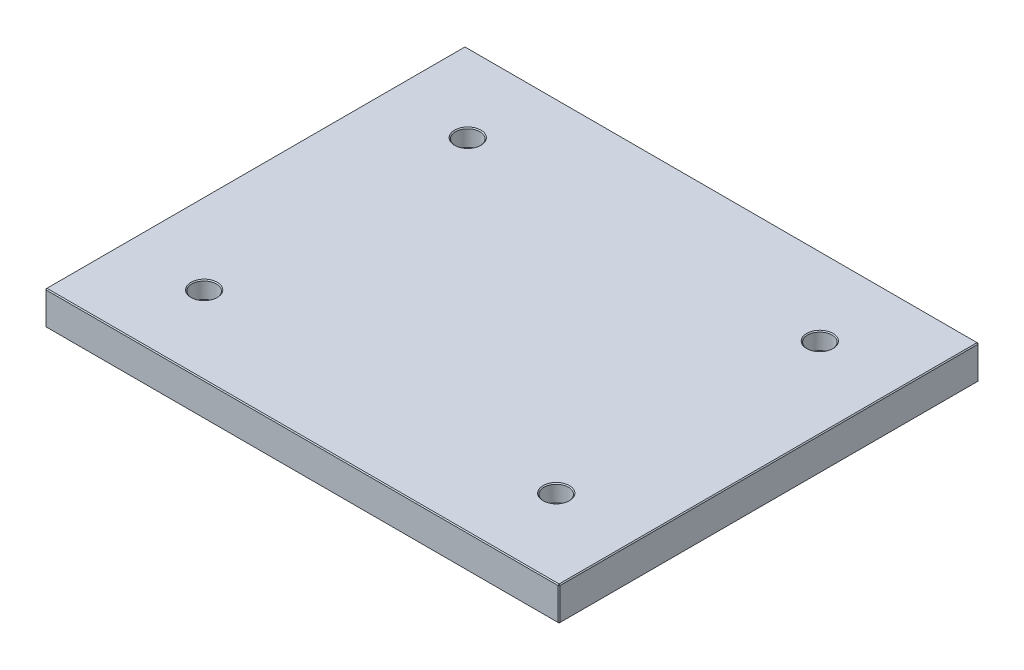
ISO-10303-21;
HEADER;
FILE_DESCRIPTION(('STEP AP214'),'2;1');
FILE_NAME('part.step','',(''),(''),'','','');
FILE_SCHEMA(('AUTOMOTIVE_DESIGN { 1 0 10303 214 1 1 1 1 }'));
ENDSEC;
DATA;
#1=APPLICATION_CONTEXT('core data for automotive mechanical design processes');
#2=APPLICATION_PROTOCOL_DEFINITION('international standard','automotive_design',2000,#1);
#3=PRODUCT_CONTEXT('',#1,'mechanical');
#4=PRODUCT('Part','Part','',(#3));
#5=PRODUCT_RELATED_PRODUCT_CATEGORY('part','',(#4));
#6=PRODUCT_DEFINITION_FORMATION('','',#4);
#7=PRODUCT_DEFINITION_CONTEXT('part definition',#1,'design');
#8=PRODUCT_DEFINITION('design','',#6,#7);
#9=PRODUCT_DEFINITION_SHAPE('','',#8);
#10=(LENGTH_UNIT() NAMED_UNIT(*) SI_UNIT(.MILLI.,.METRE.));
#11=(NAMED_UNIT(*) PLANE_ANGLE_UNIT() SI_UNIT($,.RADIAN.));
#12=(NAMED_UNIT(*) SI_UNIT($,.STERADIAN.) SOLID_ANGLE_UNIT());
#13=UNCERTAINTY_MEASURE_WITH_UNIT(LENGTH_MEASURE(1.E-05),#10,'distance_accuracy_value','');
#14=(GEOMETRIC_REPRESENTATION_CONTEXT(3) GLOBAL_UNCERTAINTY_ASSIGNED_CONTEXT((#13)) GLOBAL_UNIT_ASSIGNED_CONTEXT((#10,
#11,#12)) REPRESENTATION_CONTEXT('',''));
#15=CARTESIAN_POINT('',(0.,0.,0.));
#16=DIRECTION('',(0.,0.,1.));
#17=DIRECTION('',(1.,0.,0.));
#18=AXIS2_PLACEMENT_3D('',#15,#16,#17);
#19=CARTESIAN_POINT('',(-273.,36.,223.));
#20=DIRECTION('',(1.,0.,0.));
#21=DIRECTION('',(0.,0.,-1.));
#22=AXIS2_PLACEMENT_3D('',#19,#20,#21);
#23=PLANE('',#22);
#24=DIRECTION('',(0.,-1.,0.));
#25=VECTOR('',#24,1.);
#26=CARTESIAN_POINT('',(-273.,36.,-222.));
#27=LINE('',#26,#25);
#28=CARTESIAN_POINT('',(-273.,35.,-222.));
#29=VERTEX_POINT('',#28);
#30=CARTESIAN_POINT('',(-273.,1.00000000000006,-222.));
#31=VERTEX_POINT('',#30);
#32=EDGE_CURVE('E115',#29,#31,#27,.T.);
#33=ORIENTED_EDGE('',*,*,#32,.T.);
#34=DIRECTION('',(0.,0.,1.));
#35=VECTOR('',#34,1.);
#36=CARTESIAN_POINT('',(-273.,1.00000000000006,223.));
#37=LINE('',#36,#35);
#38=CARTESIAN_POINT('',(-273.,1.00000000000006,222.));
#39=VERTEX_POINT('',#38);
#40=EDGE_CURVE('E111',#31,#39,#37,.T.);
#41=ORIENTED_EDGE('',*,*,#40,.T.);
#42=DIRECTION('',(0.,1.,0.));
#43=VECTOR('',#42,1.);
#44=CARTESIAN_POINT('',(-273.,36.,222.));
#45=LINE('',#44,#43);
#46=CARTESIAN_POINT('',(-273.,35.,222.));
#47=VERTEX_POINT('',#46);
#48=EDGE_CURVE('E104',#39,#47,#45,.T.);
#49=ORIENTED_EDGE('',*,*,#48,.T.);
#50=DIRECTION('',(0.,0.,-1.));
#51=VECTOR('',#50,1.);
#52=CARTESIAN_POINT('',(-273.,35.,-223.));
#53=LINE('',#52,#51);
#54=EDGE_CURVE('E108',#47,#29,#53,.T.);
#55=ORIENTED_EDGE('',*,*,#54,.T.);
#56=EDGE_LOOP('',(#33,#41,#49,#55));
#57=FACE_BOUND('',#56,.T.);
#58=ADVANCED_FACE('F16',(#57),#23,.F.);
#59=CARTESIAN_POINT('',(273.,36.,223.));
#60=DIRECTION('',(0.,0.,-1.));
#61=DIRECTION('',(-1.,0.,0.));
#62=AXIS2_PLACEMENT_3D('',#59,#60,#61);
#63=PLANE('',#62);
#64=DIRECTION('',(-1.,0.,0.));
#65=VECTOR('',#64,1.);
#66=CARTESIAN_POINT('',(-273.,35.,223.));
#67=LINE('',#66,#65);
#68=CARTESIAN_POINT('',(272.,35.,223.));
#69=VERTEX_POINT('',#68);
#70=CARTESIAN_POINT('',(-272.,35.,223.));
#71=VERTEX_POINT('',#70);
#72=EDGE_CURVE('E170',#69,#71,#67,.T.);
#73=ORIENTED_EDGE('',*,*,#72,.T.);
#74=DIRECTION('',(0.,-1.,0.));
#75=VECTOR('',#74,1.);
#76=CARTESIAN_POINT('',(-272.,36.,223.));
#77=LINE('',#76,#75);
#78=CARTESIAN_POINT('',(-272.,1.00000000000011,223.));
#79=VERTEX_POINT('',#78);
#80=EDGE_CURVE('E123',#71,#79,#77,.T.);
#81=ORIENTED_EDGE('',*,*,#80,.T.);
#82=DIRECTION('',(1.,0.,0.));
#83=VECTOR('',#82,1.);
#84=CARTESIAN_POINT('',(273.,1.00000000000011,223.));
#85=LINE('',#84,#83);
#86=CARTESIAN_POINT('',(272.,1.00000000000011,223.));
#87=VERTEX_POINT('',#86);
#88=EDGE_CURVE('E174',#79,#87,#85,.T.);
#89=ORIENTED_EDGE('',*,*,#88,.T.);
#90=DIRECTION('',(0.,1.,0.));
#91=VECTOR('',#90,1.);
#92=CARTESIAN_POINT('',(272.,36.,223.));
#93=LINE('',#92,#91);
#94=EDGE_CURVE('E172',#87,#69,#93,.T.);
#95=ORIENTED_EDGE('',*,*,#94,.T.);
#96=EDGE_LOOP('',(#73,#81,#89,#95));
#97=FACE_BOUND('',#96,.T.);
#98=ADVANCED_FACE('F317',(#97),#63,.F.);
#99=CARTESIAN_POINT('',(273.,36.,223.));
#100=DIRECTION('',(-1.,0.,0.));
#101=DIRECTION('',(0.,0.,1.));
#102=AXIS2_PLACEMENT_3D('',#99,#100,#101);
#103=PLANE('',#102);
#104=DIRECTION('',(0.,0.,-1.));
#105=VECTOR('',#104,1.);
#106=CARTESIAN_POINT('',(273.,1.00000000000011,223.));
#107=LINE('',#106,#105);
#108=CARTESIAN_POINT('',(273.,1.00000000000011,222.));
#109=VERTEX_POINT('',#108);
#110=CARTESIAN_POINT('',(273.,1.00000000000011,-222.));
#111=VERTEX_POINT('',#110);
#112=EDGE_CURVE('E165',#109,#111,#107,.T.);
#113=ORIENTED_EDGE('',*,*,#112,.T.);
#114=DIRECTION('',(0.,1.,0.));
#115=VECTOR('',#114,1.);
#116=CARTESIAN_POINT('',(273.,36.,-222.));
#117=LINE('',#116,#115);
#118=CARTESIAN_POINT('',(273.,35.,-222.));
#119=VERTEX_POINT('',#118);
#120=EDGE_CURVE('E167',#111,#119,#117,.T.);
#121=ORIENTED_EDGE('',*,*,#120,.T.);
#122=DIRECTION('',(0.,0.,1.));
#123=VECTOR('',#122,1.);
#124=CARTESIAN_POINT('',(273.,35.,223.));
#125=LINE('',#124,#123);
#126=CARTESIAN_POINT('',(273.,35.,222.));
#127=VERTEX_POINT('',#126);
#128=EDGE_CURVE('E161',#119,#127,#125,.T.);
#129=ORIENTED_EDGE('',*,*,#128,.T.);
#130=DIRECTION('',(0.,-1.,0.));
#131=VECTOR('',#130,1.);
#132=CARTESIAN_POINT('',(273.,36.,222.));
#133=LINE('',#132,#131);
#134=EDGE_CURVE('E163',#127,#109,#133,.T.);
#135=ORIENTED_EDGE('',*,*,#134,.T.);
#136=EDGE_LOOP('',(#113,#121,#129,#135));
#137=FACE_BOUND('',#136,.T.);
#138=ADVANCED_FACE('F323',(#137),#103,.F.);
#139=CARTESIAN_POINT('',(273.,36.,-223.));
#140=DIRECTION('',(0.,0.,1.));
#141=DIRECTION('',(1.,0.,0.));
#142=AXIS2_PLACEMENT_3D('',#139,#140,#141);
#143=PLANE('',#142);
#144=DIRECTION('',(0.,-1.,0.));
#145=VECTOR('',#144,1.);
#146=CARTESIAN_POINT('',(272.,36.,-223.));
#147=LINE('',#146,#145);
#148=CARTESIAN_POINT('',(272.,35.,-223.));
#149=VERTEX_POINT('',#148);
#150=CARTESIAN_POINT('',(272.,1.00000000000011,-223.));
#151=VERTEX_POINT('',#150);
#152=EDGE_CURVE('E154',#149,#151,#147,.T.);
#153=ORIENTED_EDGE('',*,*,#152,.T.);
#154=DIRECTION('',(-1.,0.,0.));
#155=VECTOR('',#154,1.);
#156=CARTESIAN_POINT('',(273.,1.00000000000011,-223.));
#157=LINE('',#156,#155);
#158=CARTESIAN_POINT('',(-272.,1.00000000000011,-223.));
#159=VERTEX_POINT('',#158);
#160=EDGE_CURVE('E159',#151,#159,#157,.T.);
#161=ORIENTED_EDGE('',*,*,#160,.T.);
#162=DIRECTION('',(0.,1.,0.));
#163=VECTOR('',#162,1.);
#164=CARTESIAN_POINT('',(-272.,36.,-223.));
#165=LINE('',#164,#163);
#166=CARTESIAN_POINT('',(-272.,35.,-223.));
#167=VERTEX_POINT('',#166);
#168=EDGE_CURVE('E156',#159,#167,#165,.T.);
#169=ORIENTED_EDGE('',*,*,#168,.T.);
#170=DIRECTION('',(1.,0.,0.));
#171=VECTOR('',#170,1.);
#172=CARTESIAN_POINT('',(273.,35.,-223.));
#173=LINE('',#172,#171);
#174=EDGE_CURVE('E152',#167,#149,#173,.T.);
#175=ORIENTED_EDGE('',*,*,#174,.T.);
#176=EDGE_LOOP('',(#153,#161,#169,#175));
#177=FACE_BOUND('',#176,.T.);
#178=ADVANCED_FACE('F465',(#177),#143,.F.);
#179=CARTESIAN_POINT('',(0.,36.,0.));
#180=DIRECTION('',(0.,1.,0.));
#181=DIRECTION('',(0.,0.,1.));
#182=AXIS2_PLACEMENT_3D('',#179,#180,#181);
#183=PLANE('',#182);
#184=CARTESIAN_POINT('',(-187.,36.,140.));
#185=DIRECTION('',(0.,1.,0.));
#186=DIRECTION('',(0.,0.,1.));
#187=AXIS2_PLACEMENT_3D('',#184,#185,#186);
#188=CIRCLE('',#187,14.);
#189=CARTESIAN_POINT('',(-187.,36.,154.));
#190=VERTEX_POINT('',#189);
#191=EDGE_CURVE('E290',#190,#190,#188,.F.);
#192=ORIENTED_EDGE('',*,*,#191,.T.);
#193=EDGE_LOOP('',(#192));
#194=FACE_BOUND('',#193,.T.);
#195=CARTESIAN_POINT('',(187.,36.,140.));
#196=DIRECTION('',(0.,1.,0.));
#197=DIRECTION('',(0.,0.,1.));
#198=AXIS2_PLACEMENT_3D('',#195,#196,#197);
#199=CIRCLE('',#198,14.);
#200=CARTESIAN_POINT('',(187.,36.,154.));
#201=VERTEX_POINT('',#200);
#202=EDGE_CURVE('E287',#201,#201,#199,.F.);
#203=ORIENTED_EDGE('',*,*,#202,.T.);
#204=EDGE_LOOP('',(#203));
#205=FACE_BOUND('',#204,.T.);
#206=CARTESIAN_POINT('',(187.,36.,-140.));
#207=DIRECTION('',(0.,1.,0.));
#208=DIRECTION('',(0.,0.,1.));
#209=AXIS2_PLACEMENT_3D('',#206,#207,#208);
#210=CIRCLE('',#209,13.9999999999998);
#211=CARTESIAN_POINT('',(187.,36.,-126.));
#212=VERTEX_POINT('',#211);
#213=EDGE_CURVE('E284',#212,#212,#210,.F.);
#214=ORIENTED_EDGE('',*,*,#213,.T.);
#215=EDGE_LOOP('',(#214));
#216=FACE_BOUND('',#215,.T.);
#217=CARTESIAN_POINT('',(-187.,36.,-140.));
#218=DIRECTION('',(0.,1.,0.));
#219=DIRECTION('',(0.,0.,1.));
#220=AXIS2_PLACEMENT_3D('',#217,#218,#219);
#221=CIRCLE('',#220,14.);
#222=CARTESIAN_POINT('',(-187.,36.,-126.));
#223=VERTEX_POINT('',#222);
#224=EDGE_CURVE('E281',#223,#223,#221,.F.);
#225=ORIENTED_EDGE('',*,*,#224,.T.);
#226=EDGE_LOOP('',(#225));
#227=FACE_BOUND('',#226,.T.);
#228=DIRECTION('',(0.,0.,-1.));
#229=VECTOR('',#228,1.);
#230=CARTESIAN_POINT('',(272.,36.,-223.));
#231=LINE('',#230,#229);
#232=CARTESIAN_POINT('',(272.,36.,222.));
#233=VERTEX_POINT('',#232);
#234=CARTESIAN_POINT('',(272.,36.,-222.));
#235=VERTEX_POINT('',#234);
#236=EDGE_CURVE('E31',#233,#235,#231,.T.);
#237=ORIENTED_EDGE('',*,*,#236,.T.);
#238=DIRECTION('',(-1.,0.,0.));
#239=VECTOR('',#238,1.);
#240=CARTESIAN_POINT('',(-273.,36.,-222.));
#241=LINE('',#240,#239);
#242=CARTESIAN_POINT('',(-272.,36.,-222.));
#243=VERTEX_POINT('',#242);
#244=EDGE_CURVE('E190',#235,#243,#241,.T.);
#245=ORIENTED_EDGE('',*,*,#244,.T.);
#246=DIRECTION('',(0.,0.,1.));
#247=VECTOR('',#246,1.);
#248=CARTESIAN_POINT('',(-272.,36.,223.));
#249=LINE('',#248,#247);
#250=CARTESIAN_POINT('',(-272.,36.,222.));
#251=VERTEX_POINT('',#250);
#252=EDGE_CURVE('E186',#243,#251,#249,.T.);
#253=ORIENTED_EDGE('',*,*,#252,.T.);
#254=DIRECTION('',(1.,0.,0.));
#255=VECTOR('',#254,1.);
#256=CARTESIAN_POINT('',(273.,36.,222.));
#257=LINE('',#256,#255);
#258=EDGE_CURVE('E36',#251,#233,#257,.T.);
#259=ORIENTED_EDGE('',*,*,#258,.T.);
#260=EDGE_LOOP('',(#237,#245,#253,#259));
#261=FACE_BOUND('',#260,.T.);
#262=ADVANCED_FACE('F462',(#194,#205,#216,#227,#261),#183,.T.);
#263=CARTESIAN_POINT('',(0.,0.,0.));
#264=DIRECTION('',(0.,1.,0.));
#265=DIRECTION('',(0.,0.,1.));
#266=AXIS2_PLACEMENT_3D('',#263,#264,#265);
#267=PLANE('',#266);
#268=CARTESIAN_POINT('',(187.,0.,-140.));
#269=DIRECTION('',(0.,1.,0.));
#270=DIRECTION('',(0.,0.,1.));
#271=AXIS2_PLACEMENT_3D('',#268,#269,#270);
#272=CIRCLE('',#271,10.);
#273=CARTESIAN_POINT('',(187.,0.,-130.));
#274=VERTEX_POINT('',#273);
#275=EDGE_CURVE('E263',#274,#274,#272,.T.);
#276=ORIENTED_EDGE('',*,*,#275,.T.);
#277=EDGE_LOOP('',(#276));
#278=FACE_BOUND('',#277,.T.);
#279=CARTESIAN_POINT('',(187.,0.,140.));
#280=DIRECTION('',(0.,1.,0.));
#281=DIRECTION('',(0.,0.,1.));
#282=AXIS2_PLACEMENT_3D('',#279,#280,#281);
#283=CIRCLE('',#282,10.);
#284=CARTESIAN_POINT('',(187.,0.,150.));
#285=VERTEX_POINT('',#284);
#286=EDGE_CURVE('E260',#285,#285,#283,.T.);
#287=ORIENTED_EDGE('',*,*,#286,.T.);
#288=EDGE_LOOP('',(#287));
#289=FACE_BOUND('',#288,.T.);
#290=CARTESIAN_POINT('',(-187.,0.,140.));
#291=DIRECTION('',(0.,1.,0.));
#292=DIRECTION('',(0.,0.,1.));
#293=AXIS2_PLACEMENT_3D('',#290,#291,#292);
#294=CIRCLE('',#293,10.);
#295=CARTESIAN_POINT('',(-187.,0.,150.));
#296=VERTEX_POINT('',#295);
#297=EDGE_CURVE('E257',#296,#296,#294,.T.);
#298=ORIENTED_EDGE('',*,*,#297,.T.);
#299=EDGE_LOOP('',(#298));
#300=FACE_BOUND('',#299,.T.);
#301=CARTESIAN_POINT('',(-187.,0.,-140.));
#302=DIRECTION('',(0.,1.,0.));
#303=DIRECTION('',(0.,0.,1.));
#304=AXIS2_PLACEMENT_3D('',#301,#302,#303);
#305=CIRCLE('',#304,10.);
#306=CARTESIAN_POINT('',(-187.,0.,-130.));
#307=VERTEX_POINT('',#306);
#308=EDGE_CURVE('E192',#307,#307,#305,.T.);
#309=ORIENTED_EDGE('',*,*,#308,.T.);
#310=EDGE_LOOP('',(#309));
#311=FACE_BOUND('',#310,.T.);
#312=DIRECTION('',(0.,0.,1.));
#313=VECTOR('',#312,1.);
#314=CARTESIAN_POINT('',(272.,0.,0.));
#315=LINE('',#314,#313);
#316=CARTESIAN_POINT('',(272.,0.,-222.));
#317=VERTEX_POINT('',#316);
#318=CARTESIAN_POINT('',(272.,0.,222.));
#319=VERTEX_POINT('',#318);
#320=EDGE_CURVE('E177',#317,#319,#315,.T.);
#321=ORIENTED_EDGE('',*,*,#320,.T.);
#322=DIRECTION('',(-1.,0.,0.));
#323=VECTOR('',#322,1.);
#324=CARTESIAN_POINT('',(0.,0.,222.));
#325=LINE('',#324,#323);
#326=CARTESIAN_POINT('',(-272.,0.,222.));
#327=VERTEX_POINT('',#326);
#328=EDGE_CURVE('E183',#319,#327,#325,.T.);
#329=ORIENTED_EDGE('',*,*,#328,.T.);
#330=DIRECTION('',(0.,0.,-1.));
#331=VECTOR('',#330,1.);
#332=CARTESIAN_POINT('',(-272.,0.,0.));
#333=LINE('',#332,#331);
#334=CARTESIAN_POINT('',(-272.,0.,-222.));
#335=VERTEX_POINT('',#334);
#336=EDGE_CURVE('E181',#327,#335,#333,.T.);
#337=ORIENTED_EDGE('',*,*,#336,.T.);
#338=DIRECTION('',(1.,0.,0.));
#339=VECTOR('',#338,1.);
#340=CARTESIAN_POINT('',(0.,0.,-222.));
#341=LINE('',#340,#339);
#342=EDGE_CURVE('E179',#335,#317,#341,.T.);
#343=ORIENTED_EDGE('',*,*,#342,.T.);
#344=EDGE_LOOP('',(#321,#329,#337,#343));
#345=FACE_BOUND('',#344,.T.);
#346=ADVANCED_FACE('F402',(#278,#289,#300,#311,#345),#267,.F.);
#347=CARTESIAN_POINT('',(273.,36.,222.));
#348=DIRECTION('',(-0.707106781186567,0.,-0.707106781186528));
#349=DIRECTION('',(0.,-1.,0.));
#350=AXIS2_PLACEMENT_3D('',#347,#348,#349);
#351=PLANE('',#350);
#352=DIRECTION('',(-0.707106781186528,0.,0.707106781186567));
#353=VECTOR('',#352,1.);
#354=CARTESIAN_POINT('',(272.,35.,223.));
#355=LINE('',#354,#353);
#356=EDGE_CURVE('E141',#69,#127,#355,.F.);
#357=ORIENTED_EDGE('',*,*,#356,.F.);
#358=ORIENTED_EDGE('',*,*,#94,.F.);
#359=DIRECTION('',(0.707106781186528,0.,-0.707106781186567));
#360=VECTOR('',#359,1.);
#361=CARTESIAN_POINT('',(272.,1.00000000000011,223.));
#362=LINE('',#361,#360);
#363=EDGE_CURVE('E144',#109,#87,#362,.F.);
#364=ORIENTED_EDGE('',*,*,#363,.F.);
#365=ORIENTED_EDGE('',*,*,#134,.F.);
#366=EDGE_LOOP('',(#357,#358,#364,#365));
#367=FACE_BOUND('',#366,.T.);
#368=ADVANCED_FACE('F398',(#367),#351,.F.);
#369=CARTESIAN_POINT('',(272.,35.,223.));
#370=DIRECTION('',(0.577350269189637,0.577350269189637,0.577350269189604));
#371=DIRECTION('',(-0.707106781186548,0.707106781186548,0.));
#372=AXIS2_PLACEMENT_3D('',#369,#370,#371);
#373=PLANE('',#372);
#374=DIRECTION('',(0.,-0.707106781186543,0.707106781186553));
#375=VECTOR('',#374,1.);
#376=CARTESIAN_POINT('',(272.,35.,223.));
#377=LINE('',#376,#375);
#378=EDGE_CURVE('E235',#69,#233,#377,.F.);
#379=ORIENTED_EDGE('',*,*,#378,.F.);
#380=ORIENTED_EDGE('',*,*,#356,.T.);
#381=DIRECTION('',(-0.707106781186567,0.707106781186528,0.));
#382=VECTOR('',#381,1.);
#383=CARTESIAN_POINT('',(272.5,35.5,222.));
#384=LINE('',#383,#382);
#385=EDGE_CURVE('E237',#233,#127,#384,.F.);
#386=ORIENTED_EDGE('',*,*,#385,.F.);
#387=EDGE_LOOP('',(#379,#380,#386));
#388=FACE_BOUND('',#387,.T.);
#389=ADVANCED_FACE('F394',(#388),#373,.T.);
#390=CARTESIAN_POINT('',(272.,1.00000000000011,223.));
#391=DIRECTION('',(0.577350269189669,-0.577350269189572,0.577350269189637));
#392=DIRECTION('',(0.707106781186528,0.,-0.707106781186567));
#393=AXIS2_PLACEMENT_3D('',#390,#391,#392);
#394=PLANE('',#393);
#395=DIRECTION('',(-0.707106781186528,-0.707106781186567,0.));
#396=VECTOR('',#395,1.);
#397=CARTESIAN_POINT('',(272.5,0.500000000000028,222.));
#398=LINE('',#397,#396);
#399=EDGE_CURVE('E229',#109,#319,#398,.T.);
#400=ORIENTED_EDGE('',*,*,#399,.F.);
#401=ORIENTED_EDGE('',*,*,#363,.T.);
#402=DIRECTION('',(0.,0.707106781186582,0.707106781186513));
#403=VECTOR('',#402,1.);
#404=CARTESIAN_POINT('',(272.,1.00000000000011,223.));
#405=LINE('',#404,#403);
#406=EDGE_CURVE('E232',#319,#87,#405,.T.);
#407=ORIENTED_EDGE('',*,*,#406,.F.);
#408=EDGE_LOOP('',(#400,#401,#407));
#409=FACE_BOUND('',#408,.T.);
#410=ADVANCED_FACE('F390',(#409),#394,.T.);
#411=CARTESIAN_POINT('',(272.,36.,0.));
#412=DIRECTION('',(0.707106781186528,0.707106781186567,0.));
#413=DIRECTION('',(0.,0.,1.));
#414=AXIS2_PLACEMENT_3D('',#411,#412,#413);
#415=PLANE('',#414);
#416=ORIENTED_EDGE('',*,*,#385,.T.);
#417=ORIENTED_EDGE('',*,*,#128,.F.);
#418=DIRECTION('',(0.707106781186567,-0.707106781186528,0.));
#419=VECTOR('',#418,1.);
#420=CARTESIAN_POINT('',(273.,35.,-222.));
#421=LINE('',#420,#419);
#422=EDGE_CURVE('E224',#235,#119,#421,.T.);
#423=ORIENTED_EDGE('',*,*,#422,.F.);
#424=ORIENTED_EDGE('',*,*,#236,.F.);
#425=EDGE_LOOP('',(#416,#417,#423,#424));
#426=FACE_BOUND('',#425,.T.);
#427=ADVANCED_FACE('F386',(#426),#415,.T.);
#428=CARTESIAN_POINT('',(0.,36.,222.));
#429=DIRECTION('',(0.,0.707106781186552,0.707106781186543));
#430=DIRECTION('',(-1.,0.,0.));
#431=AXIS2_PLACEMENT_3D('',#428,#429,#430);
#432=PLANE('',#431);
#433=ORIENTED_EDGE('',*,*,#378,.T.);
#434=ORIENTED_EDGE('',*,*,#258,.F.);
#435=DIRECTION('',(0.,0.707106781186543,-0.707106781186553));
#436=VECTOR('',#435,1.);
#437=CARTESIAN_POINT('',(-272.,35.5,222.5));
#438=LINE('',#437,#436);
#439=EDGE_CURVE('E127',#71,#251,#438,.T.);
#440=ORIENTED_EDGE('',*,*,#439,.F.);
#441=ORIENTED_EDGE('',*,*,#72,.F.);
#442=EDGE_LOOP('',(#433,#434,#440,#441));
#443=FACE_BOUND('',#442,.T.);
#444=ADVANCED_FACE('F383',(#443),#432,.T.);
#445=CARTESIAN_POINT('',(-272.,36.,223.));
#446=DIRECTION('',(0.707106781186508,0.,-0.707106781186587));
#447=DIRECTION('',(0.,-1.,0.));
#448=AXIS2_PLACEMENT_3D('',#445,#446,#447);
#449=PLANE('',#448);
#450=DIRECTION('',(0.707106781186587,0.,0.707106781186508));
#451=VECTOR('',#450,1.);
#452=CARTESIAN_POINT('',(-272.,1.00000000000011,223.));
#453=LINE('',#452,#451);
#454=EDGE_CURVE('E128',#79,#39,#453,.F.);
#455=ORIENTED_EDGE('',*,*,#454,.F.);
#456=ORIENTED_EDGE('',*,*,#80,.F.);
#457=DIRECTION('',(-0.707106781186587,0.,-0.707106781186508));
#458=VECTOR('',#457,1.);
#459=CARTESIAN_POINT('',(-273.,35.,222.));
#460=LINE('',#459,#458);
#461=EDGE_CURVE('E119',#47,#71,#460,.F.);
#462=ORIENTED_EDGE('',*,*,#461,.F.);
#463=ORIENTED_EDGE('',*,*,#48,.F.);
#464=EDGE_LOOP('',(#455,#456,#462,#463));
#465=FACE_BOUND('',#464,.T.);
#466=ADVANCED_FACE('F121',(#465),#449,.F.);
#467=CARTESIAN_POINT('',(273.,1.00000000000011,223.));
#468=DIRECTION('',(0.,0.707106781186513,-0.707106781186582));
#469=DIRECTION('',(1.,0.,0.));
#470=AXIS2_PLACEMENT_3D('',#467,#468,#469);
#471=PLANE('',#470);
#472=ORIENTED_EDGE('',*,*,#406,.T.);
#473=ORIENTED_EDGE('',*,*,#88,.F.);
#474=DIRECTION('',(0.,-0.707106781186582,-0.707106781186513));
#475=VECTOR('',#474,1.);
#476=CARTESIAN_POINT('',(-272.,1.00000000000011,223.));
#477=LINE('',#476,#475);
#478=EDGE_CURVE('E220',#327,#79,#477,.F.);
#479=ORIENTED_EDGE('',*,*,#478,.F.);
#480=ORIENTED_EDGE('',*,*,#328,.F.);
#481=EDGE_LOOP('',(#472,#473,#479,#480));
#482=FACE_BOUND('',#481,.T.);
#483=ADVANCED_FACE('F376',(#482),#471,.F.);
#484=CARTESIAN_POINT('',(273.,1.00000000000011,223.));
#485=DIRECTION('',(-0.707106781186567,0.707106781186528,0.));
#486=DIRECTION('',(0.,0.,-1.));
#487=AXIS2_PLACEMENT_3D('',#484,#485,#486);
#488=PLANE('',#487);
#489=ORIENTED_EDGE('',*,*,#399,.T.);
#490=ORIENTED_EDGE('',*,*,#320,.F.);
#491=DIRECTION('',(0.707106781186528,0.707106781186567,0.));
#492=VECTOR('',#491,1.);
#493=CARTESIAN_POINT('',(272.5,0.500000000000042,-222.));
#494=LINE('',#493,#492);
#495=EDGE_CURVE('E217',#111,#317,#494,.F.);
#496=ORIENTED_EDGE('',*,*,#495,.F.);
#497=ORIENTED_EDGE('',*,*,#112,.F.);
#498=EDGE_LOOP('',(#489,#490,#496,#497));
#499=FACE_BOUND('',#498,.T.);
#500=ADVANCED_FACE('F372',(#499),#488,.F.);
#501=CARTESIAN_POINT('',(272.,36.,-223.));
#502=DIRECTION('',(-0.707106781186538,0.,0.707106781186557));
#503=DIRECTION('',(0.,-1.,0.));
#504=AXIS2_PLACEMENT_3D('',#501,#502,#503);
#505=PLANE('',#504);
#506=DIRECTION('',(0.707106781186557,0.,0.707106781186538));
#507=VECTOR('',#506,1.);
#508=CARTESIAN_POINT('',(273.,35.,-222.));
#509=LINE('',#508,#507);
#510=EDGE_CURVE('E226',#119,#149,#509,.F.);
#511=ORIENTED_EDGE('',*,*,#510,.F.);
#512=ORIENTED_EDGE('',*,*,#120,.F.);
#513=DIRECTION('',(-0.707106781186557,0.,-0.707106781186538));
#514=VECTOR('',#513,1.);
#515=CARTESIAN_POINT('',(272.,1.00000000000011,-223.));
#516=LINE('',#515,#514);
#517=EDGE_CURVE('E214',#151,#111,#516,.F.);
#518=ORIENTED_EDGE('',*,*,#517,.F.);
#519=ORIENTED_EDGE('',*,*,#152,.F.);
#520=EDGE_LOOP('',(#511,#512,#518,#519));
#521=FACE_BOUND('',#520,.T.);
#522=ADVANCED_FACE('F368',(#521),#505,.F.);
#523=CARTESIAN_POINT('',(273.,35.,-222.));
#524=DIRECTION('',(0.577350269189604,0.577350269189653,-0.57735026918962));
#525=DIRECTION('',(0.,0.707106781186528,0.707106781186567));
#526=AXIS2_PLACEMENT_3D('',#523,#524,#525);
#527=PLANE('',#526);
#528=ORIENTED_EDGE('',*,*,#422,.T.);
#529=ORIENTED_EDGE('',*,*,#510,.T.);
#530=DIRECTION('',(0.,0.707106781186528,0.707106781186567));
#531=VECTOR('',#530,1.);
#532=CARTESIAN_POINT('',(272.,35.5,-222.5));
#533=LINE('',#532,#531);
#534=EDGE_CURVE('E135',#235,#149,#533,.F.);
#535=ORIENTED_EDGE('',*,*,#534,.F.);
#536=EDGE_LOOP('',(#528,#529,#535));
#537=FACE_BOUND('',#536,.T.);
#538=ADVANCED_FACE('F365',(#537),#527,.T.);
#539=CARTESIAN_POINT('',(-273.,35.,222.));
#540=DIRECTION('',(-0.577350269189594,0.577350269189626,0.577350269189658));
#541=DIRECTION('',(0.,-0.707106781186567,0.707106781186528));
#542=AXIS2_PLACEMENT_3D('',#539,#540,#541);
#543=PLANE('',#542);
#544=ORIENTED_EDGE('',*,*,#461,.T.);
#545=ORIENTED_EDGE('',*,*,#439,.T.);
#546=DIRECTION('',(-0.707106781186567,-0.707106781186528,0.));
#547=VECTOR('',#546,1.);
#548=CARTESIAN_POINT('',(-273.,35.,222.));
#549=LINE('',#548,#547);
#550=EDGE_CURVE('E131',#47,#251,#549,.F.);
#551=ORIENTED_EDGE('',*,*,#550,.F.);
#552=EDGE_LOOP('',(#544,#545,#551));
#553=FACE_BOUND('',#552,.T.);
#554=ADVANCED_FACE('F132',(#553),#543,.T.);
#555=CARTESIAN_POINT('',(-272.,1.00000000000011,223.));
#556=DIRECTION('',(-0.577350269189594,-0.577350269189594,0.57735026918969));
#557=DIRECTION('',(0.707106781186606,0.,0.707106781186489));
#558=AXIS2_PLACEMENT_3D('',#555,#556,#557);
#559=PLANE('',#558);
#560=ORIENTED_EDGE('',*,*,#478,.T.);
#561=ORIENTED_EDGE('',*,*,#454,.T.);
#562=DIRECTION('',(-0.707106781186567,0.707106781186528,0.));
#563=VECTOR('',#562,1.);
#564=CARTESIAN_POINT('',(-272.5,0.499999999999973,222.));
#565=LINE('',#564,#563);
#566=EDGE_CURVE('E136',#327,#39,#565,.T.);
#567=ORIENTED_EDGE('',*,*,#566,.F.);
#568=EDGE_LOOP('',(#560,#561,#567));
#569=FACE_BOUND('',#568,.T.);
#570=ADVANCED_FACE('F358',(#569),#559,.T.);
#571=CARTESIAN_POINT('',(272.,1.00000000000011,-223.));
#572=DIRECTION('',(0.577350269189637,-0.577350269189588,-0.577350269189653));
#573=DIRECTION('',(-0.707106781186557,0.,-0.707106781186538));
#574=AXIS2_PLACEMENT_3D('',#571,#572,#573);
#575=PLANE('',#574);
#576=ORIENTED_EDGE('',*,*,#517,.T.);
#577=ORIENTED_EDGE('',*,*,#495,.T.);
#578=DIRECTION('',(0.,-0.707106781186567,0.707106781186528));
#579=VECTOR('',#578,1.);
#580=CARTESIAN_POINT('',(272.,1.00000000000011,-223.));
#581=LINE('',#580,#579);
#582=EDGE_CURVE('E207',#151,#317,#581,.T.);
#583=ORIENTED_EDGE('',*,*,#582,.F.);
#584=EDGE_LOOP('',(#576,#577,#583));
#585=FACE_BOUND('',#584,.T.);
#586=ADVANCED_FACE('F354',(#585),#575,.T.);
#587=CARTESIAN_POINT('',(0.,36.,-222.));
#588=DIRECTION('',(0.,0.707106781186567,-0.707106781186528));
#589=DIRECTION('',(1.,0.,0.));
#590=AXIS2_PLACEMENT_3D('',#587,#588,#589);
#591=PLANE('',#590);
#592=ORIENTED_EDGE('',*,*,#534,.T.);
#593=ORIENTED_EDGE('',*,*,#174,.F.);
#594=DIRECTION('',(0.,-0.707106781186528,-0.707106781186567));
#595=VECTOR('',#594,1.);
#596=CARTESIAN_POINT('',(-272.,35.,-223.));
#597=LINE('',#596,#595);
#598=EDGE_CURVE('E204',#243,#167,#597,.T.);
#599=ORIENTED_EDGE('',*,*,#598,.F.);
#600=ORIENTED_EDGE('',*,*,#244,.F.);
#601=EDGE_LOOP('',(#592,#593,#599,#600));
#602=FACE_BOUND('',#601,.T.);
#603=ADVANCED_FACE('F351',(#602),#591,.T.);
#604=CARTESIAN_POINT('',(-272.,36.,0.));
#605=DIRECTION('',(-0.707106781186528,0.707106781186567,0.));
#606=DIRECTION('',(0.,0.,-1.));
#607=AXIS2_PLACEMENT_3D('',#604,#605,#606);
#608=PLANE('',#607);
#609=ORIENTED_EDGE('',*,*,#550,.T.);
#610=ORIENTED_EDGE('',*,*,#252,.F.);
#611=DIRECTION('',(0.707106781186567,0.707106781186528,0.));
#612=VECTOR('',#611,1.);
#613=CARTESIAN_POINT('',(-272.5,35.5,-222.));
#614=LINE('',#613,#612);
#615=EDGE_CURVE('E139',#29,#243,#614,.T.);
#616=ORIENTED_EDGE('',*,*,#615,.F.);
#617=ORIENTED_EDGE('',*,*,#54,.F.);
#618=EDGE_LOOP('',(#609,#610,#616,#617));
#619=FACE_BOUND('',#618,.T.);
#620=ADVANCED_FACE('F138',(#619),#608,.T.);
#621=CARTESIAN_POINT('',(-273.,1.00000000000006,223.));
#622=DIRECTION('',(0.707106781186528,0.707106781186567,0.));
#623=DIRECTION('',(0.,0.,1.));
#624=AXIS2_PLACEMENT_3D('',#621,#622,#623);
#625=PLANE('',#624);
#626=ORIENTED_EDGE('',*,*,#566,.T.);
#627=ORIENTED_EDGE('',*,*,#40,.F.);
#628=DIRECTION('',(0.707106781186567,-0.707106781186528,0.));
#629=VECTOR('',#628,1.);
#630=CARTESIAN_POINT('',(-273.,1.00000000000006,-222.));
#631=LINE('',#630,#629);
#632=EDGE_CURVE('E200',#335,#31,#631,.F.);
#633=ORIENTED_EDGE('',*,*,#632,.F.);
#634=ORIENTED_EDGE('',*,*,#336,.F.);
#635=EDGE_LOOP('',(#626,#627,#633,#634));
#636=FACE_BOUND('',#635,.T.);
#637=ADVANCED_FACE('F344',(#636),#625,.F.);
#638=CARTESIAN_POINT('',(273.,1.00000000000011,-223.));
#639=DIRECTION('',(0.,0.707106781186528,0.707106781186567));
#640=DIRECTION('',(-1.,0.,0.));
#641=AXIS2_PLACEMENT_3D('',#638,#639,#640);
#642=PLANE('',#641);
#643=ORIENTED_EDGE('',*,*,#582,.T.);
#644=ORIENTED_EDGE('',*,*,#342,.F.);
#645=DIRECTION('',(0.,0.707106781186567,-0.707106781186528));
#646=VECTOR('',#645,1.);
#647=CARTESIAN_POINT('',(-272.,0.500000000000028,-222.5));
#648=LINE('',#647,#646);
#649=EDGE_CURVE('E197',#159,#335,#648,.F.);
#650=ORIENTED_EDGE('',*,*,#649,.F.);
#651=ORIENTED_EDGE('',*,*,#160,.F.);
#652=EDGE_LOOP('',(#643,#644,#650,#651));
#653=FACE_BOUND('',#652,.T.);
#654=ADVANCED_FACE('F340',(#653),#642,.F.);
#655=CARTESIAN_POINT('',(-272.,35.,-223.));
#656=DIRECTION('',(-0.577350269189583,0.577350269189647,-0.577350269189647));
#657=DIRECTION('',(0.,0.707106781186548,0.707106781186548));
#658=AXIS2_PLACEMENT_3D('',#655,#656,#657);
#659=PLANE('',#658);
#660=ORIENTED_EDGE('',*,*,#615,.T.);
#661=ORIENTED_EDGE('',*,*,#598,.T.);
#662=DIRECTION('',(0.707106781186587,0.,-0.707106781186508));
#663=VECTOR('',#662,1.);
#664=CARTESIAN_POINT('',(-272.,35.,-223.));
#665=LINE('',#664,#663);
#666=EDGE_CURVE('E195',#29,#167,#665,.T.);
#667=ORIENTED_EDGE('',*,*,#666,.F.);
#668=EDGE_LOOP('',(#660,#661,#667));
#669=FACE_BOUND('',#668,.T.);
#670=ADVANCED_FACE('F336',(#669),#659,.T.);
#671=CARTESIAN_POINT('',(-273.,1.00000000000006,-222.));
#672=DIRECTION('',(-0.577350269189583,-0.577350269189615,-0.577350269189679));
#673=DIRECTION('',(0.,0.707106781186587,-0.707106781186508));
#674=AXIS2_PLACEMENT_3D('',#671,#672,#673);
#675=PLANE('',#674);
#676=ORIENTED_EDGE('',*,*,#649,.T.);
#677=ORIENTED_EDGE('',*,*,#632,.T.);
#678=DIRECTION('',(-0.707106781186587,0.,0.707106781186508));
#679=VECTOR('',#678,1.);
#680=CARTESIAN_POINT('',(-273.,1.00000000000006,-222.));
#681=LINE('',#680,#679);
#682=EDGE_CURVE('E193',#159,#31,#681,.T.);
#683=ORIENTED_EDGE('',*,*,#682,.F.);
#684=EDGE_LOOP('',(#676,#677,#683));
#685=FACE_BOUND('',#684,.T.);
#686=ADVANCED_FACE('F332',(#685),#675,.T.);
#687=CARTESIAN_POINT('',(-273.,36.,-222.));
#688=DIRECTION('',(0.707106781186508,0.,0.707106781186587));
#689=DIRECTION('',(0.,-1.,0.));
#690=AXIS2_PLACEMENT_3D('',#687,#688,#689);
#691=PLANE('',#690);
#692=ORIENTED_EDGE('',*,*,#666,.T.);
#693=ORIENTED_EDGE('',*,*,#168,.F.);
#694=ORIENTED_EDGE('',*,*,#682,.T.);
#695=ORIENTED_EDGE('',*,*,#32,.F.);
#696=EDGE_LOOP('',(#692,#693,#694,#695));
#697=FACE_BOUND('',#696,.T.);
#698=ADVANCED_FACE('F328',(#697),#691,.F.);
#699=CARTESIAN_POINT('',(-187.,18.,-140.));
#700=DIRECTION('',(0.,1.,0.));
#701=DIRECTION('',(0.,0.,1.));
#702=AXIS2_PLACEMENT_3D('',#699,#700,#701);
#703=CYLINDRICAL_SURFACE('',#702,13.);
#704=CARTESIAN_POINT('',(-187.,35.,-140.));
#705=DIRECTION('',(0.,1.,0.));
#706=DIRECTION('',(0.,0.,1.));
#707=AXIS2_PLACEMENT_3D('',#704,#705,#706);
#708=CIRCLE('',#707,13.);
#709=CARTESIAN_POINT('',(-187.,35.,-127.));
#710=VERTEX_POINT('',#709);
#711=EDGE_CURVE('E10',#710,#710,#708,.T.);
#712=ORIENTED_EDGE('',*,*,#711,.T.);
#713=EDGE_LOOP('',(#712));
#714=FACE_BOUND('',#713,.T.);
#715=CARTESIAN_POINT('',(-187.,18.,-140.));
#716=DIRECTION('',(0.,1.,0.));
#717=DIRECTION('',(0.,0.,1.));
#718=AXIS2_PLACEMENT_3D('',#715,#716,#717);
#719=CIRCLE('',#718,13.);
#720=CARTESIAN_POINT('',(-187.,18.,-127.));
#721=VERTEX_POINT('',#720);
#722=EDGE_CURVE('E147',#721,#721,#719,.T.);
#723=ORIENTED_EDGE('',*,*,#722,.F.);
#724=EDGE_LOOP('',(#723));
#725=FACE_BOUND('',#724,.T.);
#726=ADVANCED_FACE('F331',(#714,#725),#703,.F.);
#727=CARTESIAN_POINT('',(-187.,18.,-140.));
#728=DIRECTION('',(0.,1.,0.));
#729=DIRECTION('',(0.,0.,1.));
#730=AXIS2_PLACEMENT_3D('',#727,#728,#729);
#731=PLANE('',#730);
#732=CARTESIAN_POINT('',(-187.,18.,-140.));
#733=DIRECTION('',(0.,1.,0.));
#734=DIRECTION('',(0.,0.,1.));
#735=AXIS2_PLACEMENT_3D('',#732,#733,#734);
#736=CIRCLE('',#735,9.);
#737=CARTESIAN_POINT('',(-187.,18.,-131.));
#738=VERTEX_POINT('',#737);
#739=EDGE_CURVE('E251',#738,#738,#736,.T.);
#740=ORIENTED_EDGE('',*,*,#739,.F.);
#741=EDGE_LOOP('',(#740));
#742=FACE_BOUND('',#741,.T.);
#743=ORIENTED_EDGE('',*,*,#722,.T.);
#744=EDGE_LOOP('',(#743));
#745=FACE_BOUND('',#744,.T.);
#746=ADVANCED_FACE('F450',(#742,#745),#731,.T.);
#747=CARTESIAN_POINT('',(187.,18.,-140.));
#748=DIRECTION('',(0.,1.,0.));
#749=DIRECTION('',(0.,0.,1.));
#750=AXIS2_PLACEMENT_3D('',#747,#748,#749);
#751=CYLINDRICAL_SURFACE('',#750,13.);
#752=CARTESIAN_POINT('',(187.,35.,-140.));
#753=DIRECTION('',(0.,1.,0.));
#754=DIRECTION('',(0.,0.,1.));
#755=AXIS2_PLACEMENT_3D('',#752,#753,#754);
#756=CIRCLE('',#755,13.);
#757=CARTESIAN_POINT('',(187.,35.,-127.));
#758=VERTEX_POINT('',#757);
#759=EDGE_CURVE('E24',#758,#758,#756,.T.);
#760=ORIENTED_EDGE('',*,*,#759,.T.);
#761=EDGE_LOOP('',(#760));
#762=FACE_BOUND('',#761,.T.);
#763=CARTESIAN_POINT('',(187.,18.,-140.));
#764=DIRECTION('',(0.,1.,0.));
#765=DIRECTION('',(0.,0.,1.));
#766=AXIS2_PLACEMENT_3D('',#763,#764,#765);
#767=CIRCLE('',#766,13.);
#768=CARTESIAN_POINT('',(187.,18.,-127.));
#769=VERTEX_POINT('',#768);
#770=EDGE_CURVE('E441',#769,#769,#767,.T.);
#771=ORIENTED_EDGE('',*,*,#770,.F.);
#772=EDGE_LOOP('',(#771));
#773=FACE_BOUND('',#772,.T.);
#774=ADVANCED_FACE('F298',(#762,#773),#751,.F.);
#775=CARTESIAN_POINT('',(187.,18.,-140.));
#776=DIRECTION('',(0.,1.,0.));
#777=DIRECTION('',(0.,0.,1.));
#778=AXIS2_PLACEMENT_3D('',#775,#776,#777);
#779=PLANE('',#778);
#780=CARTESIAN_POINT('',(187.,18.,-140.));
#781=DIRECTION('',(0.,1.,0.));
#782=DIRECTION('',(0.,0.,1.));
#783=AXIS2_PLACEMENT_3D('',#780,#781,#782);
#784=CIRCLE('',#783,9.);
#785=CARTESIAN_POINT('',(187.,18.,-131.));
#786=VERTEX_POINT('',#785);
#787=EDGE_CURVE('E248',#786,#786,#784,.T.);
#788=ORIENTED_EDGE('',*,*,#787,.F.);
#789=EDGE_LOOP('',(#788));
#790=FACE_BOUND('',#789,.T.);
#791=ORIENTED_EDGE('',*,*,#770,.T.);
#792=EDGE_LOOP('',(#791));
#793=FACE_BOUND('',#792,.T.);
#794=ADVANCED_FACE('F738',(#790,#793),#779,.T.);
#795=CARTESIAN_POINT('',(187.,18.,140.));
#796=DIRECTION('',(0.,1.,0.));
#797=DIRECTION('',(0.,0.,1.));
#798=AXIS2_PLACEMENT_3D('',#795,#796,#797);
#799=CYLINDRICAL_SURFACE('',#798,13.);
#800=CARTESIAN_POINT('',(187.,35.,140.));
#801=DIRECTION('',(0.,1.,0.));
#802=DIRECTION('',(0.,0.,1.));
#803=AXIS2_PLACEMENT_3D('',#800,#801,#802);
#804=CIRCLE('',#803,13.);
#805=CARTESIAN_POINT('',(187.,35.,153.));
#806=VERTEX_POINT('',#805);
#807=EDGE_CURVE('E293',#806,#806,#804,.T.);
#808=ORIENTED_EDGE('',*,*,#807,.T.);
#809=EDGE_LOOP('',(#808));
#810=FACE_BOUND('',#809,.T.);
#811=CARTESIAN_POINT('',(187.,18.,140.));
#812=DIRECTION('',(0.,1.,0.));
#813=DIRECTION('',(0.,0.,1.));
#814=AXIS2_PLACEMENT_3D('',#811,#812,#813);
#815=CIRCLE('',#814,13.);
#816=CARTESIAN_POINT('',(187.,18.,153.));
#817=VERTEX_POINT('',#816);
#818=EDGE_CURVE('E439',#817,#817,#815,.T.);
#819=ORIENTED_EDGE('',*,*,#818,.F.);
#820=EDGE_LOOP('',(#819));
#821=FACE_BOUND('',#820,.T.);
#822=ADVANCED_FACE('F730',(#810,#821),#799,.F.);
#823=CARTESIAN_POINT('',(187.,18.,140.));
#824=DIRECTION('',(0.,1.,0.));
#825=DIRECTION('',(0.,0.,1.));
#826=AXIS2_PLACEMENT_3D('',#823,#824,#825);
#827=PLANE('',#826);
#828=CARTESIAN_POINT('',(187.,18.,140.));
#829=DIRECTION('',(0.,1.,0.));
#830=DIRECTION('',(0.,0.,1.));
#831=AXIS2_PLACEMENT_3D('',#828,#829,#830);
#832=CIRCLE('',#831,9.);
#833=CARTESIAN_POINT('',(187.,18.,149.));
#834=VERTEX_POINT('',#833);
#835=EDGE_CURVE('E245',#834,#834,#832,.T.);
#836=ORIENTED_EDGE('',*,*,#835,.F.);
#837=EDGE_LOOP('',(#836));
#838=FACE_BOUND('',#837,.T.);
#839=ORIENTED_EDGE('',*,*,#818,.T.);
#840=EDGE_LOOP('',(#839));
#841=FACE_BOUND('',#840,.T.);
#842=ADVANCED_FACE('F434',(#838,#841),#827,.T.);
#843=CARTESIAN_POINT('',(-187.,18.,140.));
#844=DIRECTION('',(0.,1.,0.));
#845=DIRECTION('',(0.,0.,1.));
#846=AXIS2_PLACEMENT_3D('',#843,#844,#845);
#847=CYLINDRICAL_SURFACE('',#846,13.);
#848=CARTESIAN_POINT('',(-187.,35.,140.));
#849=DIRECTION('',(0.,1.,0.));
#850=DIRECTION('',(0.,0.,1.));
#851=AXIS2_PLACEMENT_3D('',#848,#849,#850);
#852=CIRCLE('',#851,13.);
#853=CARTESIAN_POINT('',(-187.,35.,153.));
#854=VERTEX_POINT('',#853);
#855=EDGE_CURVE('E278',#854,#854,#852,.T.);
#856=ORIENTED_EDGE('',*,*,#855,.T.);
#857=EDGE_LOOP('',(#856));
#858=FACE_BOUND('',#857,.T.);
#859=CARTESIAN_POINT('',(-187.,18.,140.));
#860=DIRECTION('',(0.,1.,0.));
#861=DIRECTION('',(0.,0.,1.));
#862=AXIS2_PLACEMENT_3D('',#859,#860,#861);
#863=CIRCLE('',#862,13.);
#864=CARTESIAN_POINT('',(-187.,18.,153.));
#865=VERTEX_POINT('',#864);
#866=EDGE_CURVE('E254',#865,#865,#863,.T.);
#867=ORIENTED_EDGE('',*,*,#866,.F.);
#868=EDGE_LOOP('',(#867));
#869=FACE_BOUND('',#868,.T.);
#870=ADVANCED_FACE('F430',(#858,#869),#847,.F.);
#871=CARTESIAN_POINT('',(-187.,18.,140.));
#872=DIRECTION('',(0.,1.,0.));
#873=DIRECTION('',(0.,0.,1.));
#874=AXIS2_PLACEMENT_3D('',#871,#872,#873);
#875=PLANE('',#874);
#876=CARTESIAN_POINT('',(-187.,18.,140.));
#877=DIRECTION('',(0.,1.,0.));
#878=DIRECTION('',(0.,0.,1.));
#879=AXIS2_PLACEMENT_3D('',#876,#877,#878);
#880=CIRCLE('',#879,9.);
#881=CARTESIAN_POINT('',(-187.,18.,149.));
#882=VERTEX_POINT('',#881);
#883=EDGE_CURVE('E242',#882,#882,#880,.T.);
#884=ORIENTED_EDGE('',*,*,#883,.F.);
#885=EDGE_LOOP('',(#884));
#886=FACE_BOUND('',#885,.T.);
#887=ORIENTED_EDGE('',*,*,#866,.T.);
#888=EDGE_LOOP('',(#887));
#889=FACE_BOUND('',#888,.T.);
#890=ADVANCED_FACE('F433',(#886,#889),#875,.T.);
#891=CARTESIAN_POINT('',(-187.,0.,140.));
#892=DIRECTION('',(0.,1.,0.));
#893=DIRECTION('',(0.,0.,1.));
#894=AXIS2_PLACEMENT_3D('',#891,#892,#893);
#895=CYLINDRICAL_SURFACE('',#894,9.);
#896=CARTESIAN_POINT('',(-187.,0.999999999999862,140.));
#897=DIRECTION('',(0.,1.,0.));
#898=DIRECTION('',(0.,0.,1.));
#899=AXIS2_PLACEMENT_3D('',#896,#897,#898);
#900=CIRCLE('',#899,9.);
#901=CARTESIAN_POINT('',(-187.,0.999999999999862,149.));
#902=VERTEX_POINT('',#901);
#903=EDGE_CURVE('E272',#902,#902,#900,.F.);
#904=ORIENTED_EDGE('',*,*,#903,.T.);
#905=EDGE_LOOP('',(#904));
#906=FACE_BOUND('',#905,.T.);
#907=ORIENTED_EDGE('',*,*,#883,.T.);
#908=EDGE_LOOP('',(#907));
#909=FACE_BOUND('',#908,.T.);
#910=ADVANCED_FACE('F705',(#906,#909),#895,.F.);
#911=CARTESIAN_POINT('',(187.,0.,140.));
#912=DIRECTION('',(0.,1.,0.));
#913=DIRECTION('',(0.,0.,1.));
#914=AXIS2_PLACEMENT_3D('',#911,#912,#913);
#915=CYLINDRICAL_SURFACE('',#914,9.);
#916=CARTESIAN_POINT('',(187.,1.00000000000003,140.));
#917=DIRECTION('',(0.,1.,0.));
#918=DIRECTION('',(0.,0.,1.));
#919=AXIS2_PLACEMENT_3D('',#916,#917,#918);
#920=CIRCLE('',#919,9.);
#921=CARTESIAN_POINT('',(187.,1.00000000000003,149.));
#922=VERTEX_POINT('',#921);
#923=EDGE_CURVE('E269',#922,#922,#920,.F.);
#924=ORIENTED_EDGE('',*,*,#923,.T.);
#925=EDGE_LOOP('',(#924));
#926=FACE_BOUND('',#925,.T.);
#927=ORIENTED_EDGE('',*,*,#835,.T.);
#928=EDGE_LOOP('',(#927));
#929=FACE_BOUND('',#928,.T.);
#930=ADVANCED_FACE('F697',(#926,#929),#915,.F.);
#931=CARTESIAN_POINT('',(187.,0.,-140.));
#932=DIRECTION('',(0.,1.,0.));
#933=DIRECTION('',(0.,0.,1.));
#934=AXIS2_PLACEMENT_3D('',#931,#932,#933);
#935=CYLINDRICAL_SURFACE('',#934,9.);
#936=CARTESIAN_POINT('',(187.,0.999999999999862,-140.));
#937=DIRECTION('',(0.,1.,0.));
#938=DIRECTION('',(0.,0.,1.));
#939=AXIS2_PLACEMENT_3D('',#936,#937,#938);
#940=CIRCLE('',#939,9.);
#941=CARTESIAN_POINT('',(187.,0.999999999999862,-131.));
#942=VERTEX_POINT('',#941);
#943=EDGE_CURVE('E266',#942,#942,#940,.F.);
#944=ORIENTED_EDGE('',*,*,#943,.T.);
#945=EDGE_LOOP('',(#944));
#946=FACE_BOUND('',#945,.T.);
#947=ORIENTED_EDGE('',*,*,#787,.T.);
#948=EDGE_LOOP('',(#947));
#949=FACE_BOUND('',#948,.T.);
#950=ADVANCED_FACE('F688',(#946,#949),#935,.F.);
#951=CARTESIAN_POINT('',(-187.,0.,-140.));
#952=DIRECTION('',(0.,1.,0.));
#953=DIRECTION('',(0.,0.,1.));
#954=AXIS2_PLACEMENT_3D('',#951,#952,#953);
#955=CYLINDRICAL_SURFACE('',#954,9.);
#956=CARTESIAN_POINT('',(-187.,0.999999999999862,-140.));
#957=DIRECTION('',(0.,1.,0.));
#958=DIRECTION('',(0.,0.,1.));
#959=AXIS2_PLACEMENT_3D('',#956,#957,#958);
#960=CIRCLE('',#959,9.);
#961=CARTESIAN_POINT('',(-187.,0.999999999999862,-131.));
#962=VERTEX_POINT('',#961);
#963=EDGE_CURVE('E275',#962,#962,#960,.F.);
#964=ORIENTED_EDGE('',*,*,#963,.T.);
#965=EDGE_LOOP('',(#964));
#966=FACE_BOUND('',#965,.T.);
#967=ORIENTED_EDGE('',*,*,#739,.T.);
#968=EDGE_LOOP('',(#967));
#969=FACE_BOUND('',#968,.T.);
#970=ADVANCED_FACE('F408',(#966,#969),#955,.F.);
#971=CARTESIAN_POINT('',(187.,0.,-140.));
#972=DIRECTION('',(0.,-1.,0.));
#973=DIRECTION('',(0.,0.,-1.));
#974=AXIS2_PLACEMENT_3D('',#971,#972,#973);
#975=CONICAL_SURFACE('',#974,10.,0.78539816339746);
#976=ORIENTED_EDGE('',*,*,#943,.F.);
#977=EDGE_LOOP('',(#976));
#978=FACE_BOUND('',#977,.T.);
#979=ORIENTED_EDGE('',*,*,#275,.F.);
#980=EDGE_LOOP('',(#979));
#981=FACE_BOUND('',#980,.T.);
#982=ADVANCED_FACE('F404',(#978,#981),#975,.F.);
#983=CARTESIAN_POINT('',(187.,0.,140.));
#984=DIRECTION('',(0.,-1.,0.));
#985=DIRECTION('',(0.,0.,-1.));
#986=AXIS2_PLACEMENT_3D('',#983,#984,#985);
#987=CONICAL_SURFACE('',#986,10.,0.78539816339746);
#988=ORIENTED_EDGE('',*,*,#923,.F.);
#989=EDGE_LOOP('',(#988));
#990=FACE_BOUND('',#989,.T.);
#991=ORIENTED_EDGE('',*,*,#286,.F.);
#992=EDGE_LOOP('',(#991));
#993=FACE_BOUND('',#992,.T.);
#994=ADVANCED_FACE('F407',(#990,#993),#987,.F.);
#995=CARTESIAN_POINT('',(-187.,0.,140.));
#996=DIRECTION('',(0.,-1.,0.));
#997=DIRECTION('',(0.,0.,-1.));
#998=AXIS2_PLACEMENT_3D('',#995,#996,#997);
#999=CONICAL_SURFACE('',#998,10.,0.78539816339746);
#1000=ORIENTED_EDGE('',*,*,#903,.F.);
#1001=EDGE_LOOP('',(#1000));
#1002=FACE_BOUND('',#1001,.T.);
#1003=ORIENTED_EDGE('',*,*,#297,.F.);
#1004=EDGE_LOOP('',(#1003));
#1005=FACE_BOUND('',#1004,.T.);
#1006=ADVANCED_FACE('F412',(#1002,#1005),#999,.F.);
#1007=CARTESIAN_POINT('',(-187.,0.,-140.));
#1008=DIRECTION('',(0.,-1.,0.));
#1009=DIRECTION('',(0.,0.,-1.));
#1010=AXIS2_PLACEMENT_3D('',#1007,#1008,#1009);
#1011=CONICAL_SURFACE('',#1010,10.,0.78539816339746);
#1012=ORIENTED_EDGE('',*,*,#963,.F.);
#1013=EDGE_LOOP('',(#1012));
#1014=FACE_BOUND('',#1013,.T.);
#1015=ORIENTED_EDGE('',*,*,#308,.F.);
#1016=EDGE_LOOP('',(#1015));
#1017=FACE_BOUND('',#1016,.T.);
#1018=ADVANCED_FACE('F416',(#1014,#1017),#1011,.F.);
#1019=CARTESIAN_POINT('',(-187.,35.,140.));
#1020=DIRECTION('',(0.,1.,0.));
#1021=DIRECTION('',(0.,0.,1.));
#1022=AXIS2_PLACEMENT_3D('',#1019,#1020,#1021);
#1023=CONICAL_SURFACE('',#1022,13.,0.785398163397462);
#1024=ORIENTED_EDGE('',*,*,#191,.F.);
#1025=EDGE_LOOP('',(#1024));
#1026=FACE_BOUND('',#1025,.T.);
#1027=ORIENTED_EDGE('',*,*,#855,.F.);
#1028=EDGE_LOOP('',(#1027));
#1029=FACE_BOUND('',#1028,.T.);
#1030=ADVANCED_FACE('F312',(#1026,#1029),#1023,.F.);
#1031=CARTESIAN_POINT('',(187.,35.,140.));
#1032=DIRECTION('',(0.,1.,0.));
#1033=DIRECTION('',(0.,0.,1.));
#1034=AXIS2_PLACEMENT_3D('',#1031,#1032,#1033);
#1035=CONICAL_SURFACE('',#1034,13.,0.785398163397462);
#1036=ORIENTED_EDGE('',*,*,#202,.F.);
#1037=EDGE_LOOP('',(#1036));
#1038=FACE_BOUND('',#1037,.T.);
#1039=ORIENTED_EDGE('',*,*,#807,.F.);
#1040=EDGE_LOOP('',(#1039));
#1041=FACE_BOUND('',#1040,.T.);
#1042=ADVANCED_FACE('F303',(#1038,#1041),#1035,.F.);
#1043=CARTESIAN_POINT('',(187.,35.,-140.));
#1044=DIRECTION('',(0.,1.,0.));
#1045=DIRECTION('',(0.,0.,1.));
#1046=AXIS2_PLACEMENT_3D('',#1043,#1044,#1045);
#1047=CONICAL_SURFACE('',#1046,13.,0.785398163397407);
#1048=ORIENTED_EDGE('',*,*,#213,.F.);
#1049=EDGE_LOOP('',(#1048));
#1050=FACE_BOUND('',#1049,.T.);
#1051=ORIENTED_EDGE('',*,*,#759,.F.);
#1052=EDGE_LOOP('',(#1051));
#1053=FACE_BOUND('',#1052,.T.);
#1054=ADVANCED_FACE('F301',(#1050,#1053),#1047,.F.);
#1055=CARTESIAN_POINT('',(-187.,35.,-140.));
#1056=DIRECTION('',(0.,1.,0.));
#1057=DIRECTION('',(0.,0.,1.));
#1058=AXIS2_PLACEMENT_3D('',#1055,#1056,#1057);
#1059=CONICAL_SURFACE('',#1058,13.,0.785398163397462);
#1060=ORIENTED_EDGE('',*,*,#224,.F.);
#1061=EDGE_LOOP('',(#1060));
#1062=FACE_BOUND('',#1061,.T.);
#1063=ORIENTED_EDGE('',*,*,#711,.F.);
#1064=EDGE_LOOP('',(#1063));
#1065=FACE_BOUND('',#1064,.T.);
#1066=ADVANCED_FACE('F18',(#1062,#1065),#1059,.F.);
#1067=CLOSED_SHELL('',(#58,#98,#138,#178,#262,#346,#368,#389,#410,#427,#444,#466,#483,#500,#522,
#538,#554,#570,#586,#603,#620,#637,#654,#670,#686,#698,#726,#746,#774,#794,#822,#842,#870,#890,
#910,#930,#950,#970,#982,#994,#1006,#1018,#1030,#1042,#1054,#1066));
#1068=MANIFOLD_SOLID_BREP('B1',#1067);
#1069=ADVANCED_BREP_SHAPE_REPRESENTATION('',(#18,#1068),#14);
#1070=SHAPE_DEFINITION_REPRESENTATION(#9,#1069);
ENDSEC;
END-ISO-10303-21;
